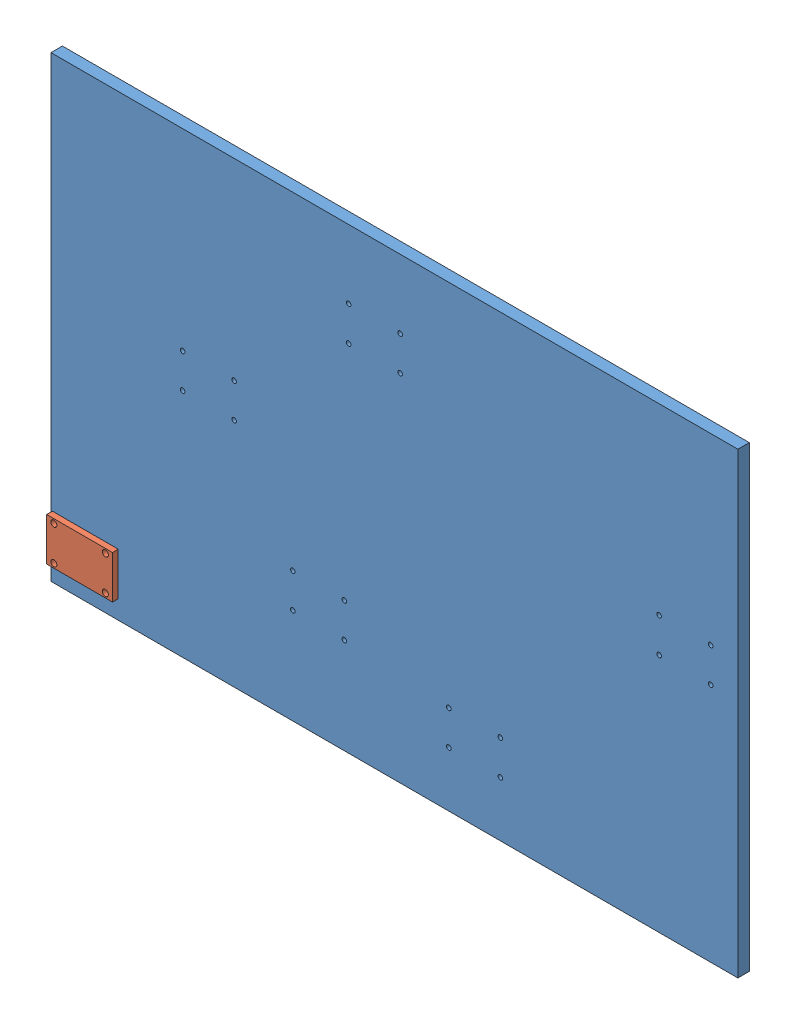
SolidWorks assembly SketchPatten.SLDASM, configuration Default (file format 4400). Lengths in mm.
Overall size (762 508 19.05).
2 component instances, 2 part files, 3 mates.
Components (placement in the parent):
- SketchPattern-1: SketchPattern.SLDPRT [Default] at origin size (762 508 12.7)
- MatesPlate-1: MatesPlate.SLDPRT [Default] at (1.5875 20.6375 12.7) size (73.03 47.62 6.35)
Mates (geometry in assembly coordinates):
- Concentric1: concentric aligned: cylinder of SketchPattern-1 through (9.525 25.4 12.7) axis (0 0 1) radius 2.5527; cylinder of MatesPlate-1 through (9.525 25.4 19.05) axis (0 0 1) radius 3.3782
- Coincident1: coincident anti-aligned: plane of SketchPattern-1 through (0 508 12.7) normal (0 0 1); plane of MatesPlate-1 through (1.5875 68.2625 12.7) normal (0 0 -1)
- Concentric2: concentric aligned: cylinder of SketchPattern-1 through (66.675 25.4 12.7) axis (0 0 1) radius 2.5527; cylinder of MatesPlate-1 through (66.675 25.4 19.05) axis (0 0 1) radius 3.3782
